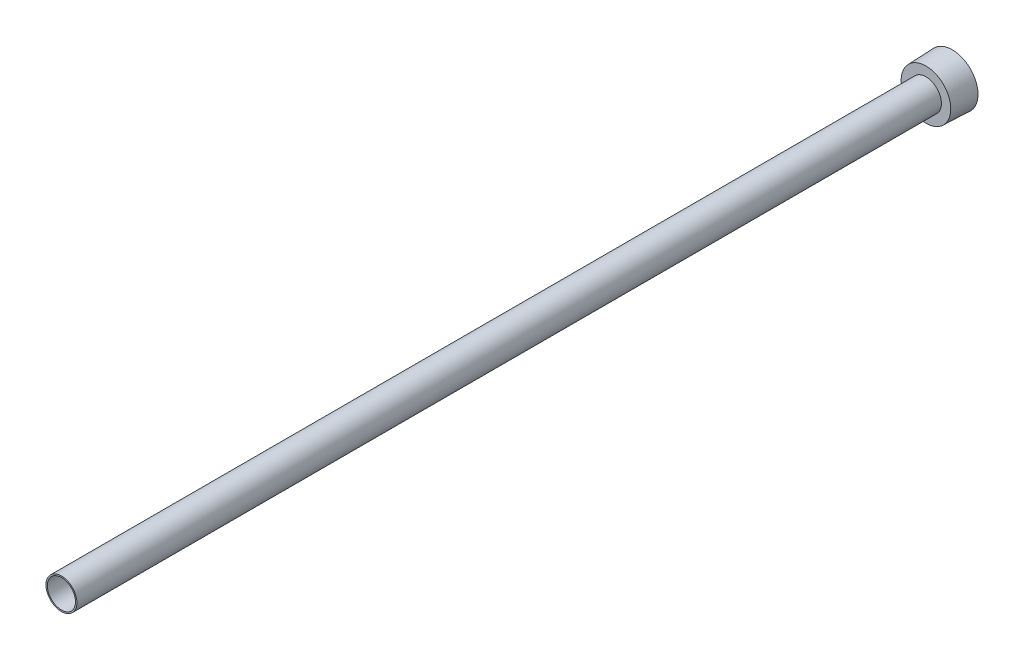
from build123d import *

# Parameters (mm, degrees)
SKETCH2_R          = 7.2263
CUT_EXTRUDE1_DEPTH = 458.582138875
CUT_EXTRUDE2_DEPTH = 9.525


with BuildPart() as part:
    # Sketch1 → Revolve1 (revolve)
    with BuildSketch(Plane(origin=(0, 0, 0), x_dir=(0, 0, -1), z_dir=(1, 0, 0)), mode=Mode.PRIVATE) as revolve1_sk:
        Polygon((-457.2, 0), (0, 0), (0, 13.2207), (-13.4874, 12.728732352), (-13.4874, 7.9375), (-457.2, 7.9375), align=None)
    revolve(revolve1_sk.sketch.rotate(Axis((0, 0, 278.001114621), (0, 0, -1)), 90), axis=Axis((0, 0, 278.001114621), (0, 0, -1)))

    # Sketch2 → Cut-Extrude1 (cut, through all)
    with BuildSketch(Plane.XY.offset(457.2)):
        Circle(SKETCH2_R)
    extrude(amount=-CUT_EXTRUDE1_DEPTH, mode=Mode.SUBTRACT)

    # Sketch3 → Cut-Extrude2 (cut)
    with BuildSketch(Plane(origin=(0, 0, 0), x_dir=(-1, 0, 0), z_dir=(0, 0, -1))):
        Polygon((-9.525, -5.499261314), (0, -10.998522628), (9.525, -5.499261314), (9.525, 5.499261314), (0, 10.998522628), (-9.525, 5.499261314), align=None)
    extrude(amount=-CUT_EXTRUDE2_DEPTH, mode=Mode.SUBTRACT)


solid = part.part
